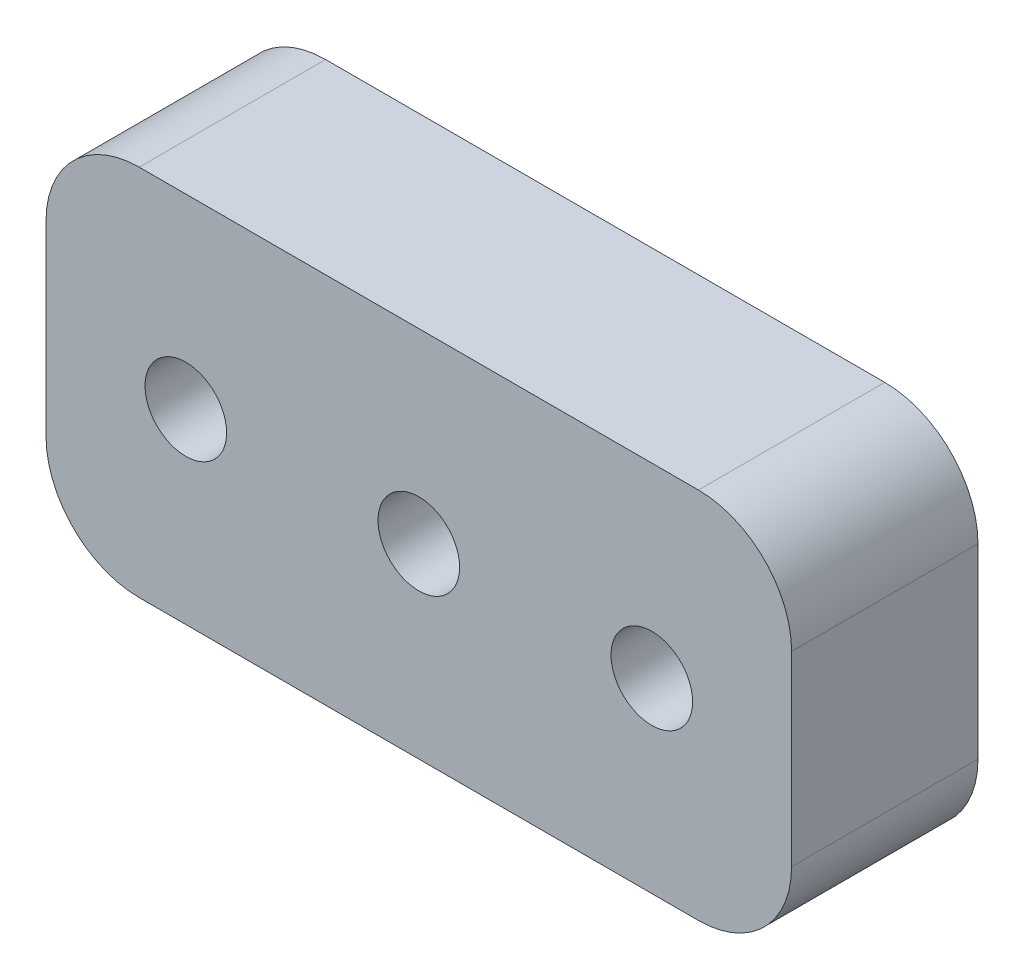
ISO-10303-21;
HEADER;
FILE_DESCRIPTION(('STEP AP214'),'2;1');
FILE_NAME('part.step','',(''),(''),'','','');
FILE_SCHEMA(('AUTOMOTIVE_DESIGN { 1 0 10303 214 1 1 1 1 }'));
ENDSEC;
DATA;
#1=APPLICATION_CONTEXT('core data for automotive mechanical design processes');
#2=APPLICATION_PROTOCOL_DEFINITION('international standard','automotive_design',2000,#1);
#3=PRODUCT_CONTEXT('',#1,'mechanical');
#4=PRODUCT('Part','Part','',(#3));
#5=PRODUCT_RELATED_PRODUCT_CATEGORY('part','',(#4));
#6=PRODUCT_DEFINITION_FORMATION('','',#4);
#7=PRODUCT_DEFINITION_CONTEXT('part definition',#1,'design');
#8=PRODUCT_DEFINITION('design','',#6,#7);
#9=PRODUCT_DEFINITION_SHAPE('','',#8);
#10=(LENGTH_UNIT() NAMED_UNIT(*) SI_UNIT(.MILLI.,.METRE.));
#11=(NAMED_UNIT(*) PLANE_ANGLE_UNIT() SI_UNIT($,.RADIAN.));
#12=(NAMED_UNIT(*) SI_UNIT($,.STERADIAN.) SOLID_ANGLE_UNIT());
#13=UNCERTAINTY_MEASURE_WITH_UNIT(LENGTH_MEASURE(1.E-05),#10,'distance_accuracy_value','');
#14=(GEOMETRIC_REPRESENTATION_CONTEXT(3) GLOBAL_UNCERTAINTY_ASSIGNED_CONTEXT((#13)) GLOBAL_UNIT_ASSIGNED_CONTEXT((#10,
#11,#12)) REPRESENTATION_CONTEXT('',''));
#15=CARTESIAN_POINT('',(0.,0.,0.));
#16=DIRECTION('',(0.,0.,1.));
#17=DIRECTION('',(1.,0.,0.));
#18=AXIS2_PLACEMENT_3D('',#15,#16,#17);
#19=CARTESIAN_POINT('',(0.,0.,12.7));
#20=DIRECTION('',(0.,0.,1.));
#21=DIRECTION('',(1.,0.,0.));
#22=AXIS2_PLACEMENT_3D('',#19,#20,#21);
#23=PLANE('',#22);
#24=CARTESIAN_POINT('',(0.,0.,12.7));
#25=DIRECTION('',(0.,0.,1.));
#26=DIRECTION('',(1.,0.,0.));
#27=AXIS2_PLACEMENT_3D('',#24,#25,#26);
#28=CIRCLE('',#27,2.77876);
#29=CARTESIAN_POINT('',(2.77876,0.,12.7));
#30=VERTEX_POINT('',#29);
#31=EDGE_CURVE('E192',#30,#30,#28,.T.);
#32=ORIENTED_EDGE('',*,*,#31,.F.);
#33=EDGE_LOOP('',(#32));
#34=FACE_BOUND('',#33,.T.);
#35=DIRECTION('',(0.,1.,0.));
#36=VECTOR('',#35,1.);
#37=CARTESIAN_POINT('',(25.4,12.7,12.7));
#38=LINE('',#37,#36);
#39=CARTESIAN_POINT('',(25.4,-6.35,12.7));
#40=VERTEX_POINT('',#39);
#41=CARTESIAN_POINT('',(25.4,6.35,12.7));
#42=VERTEX_POINT('',#41);
#43=EDGE_CURVE('E136',#40,#42,#38,.T.);
#44=ORIENTED_EDGE('',*,*,#43,.T.);
#45=CARTESIAN_POINT('',(19.05,6.35,12.7));
#46=DIRECTION('',(0.,0.,1.));
#47=DIRECTION('',(1.,0.,0.));
#48=AXIS2_PLACEMENT_3D('',#45,#46,#47);
#49=CIRCLE('',#48,6.35);
#50=CARTESIAN_POINT('',(19.05,12.7,12.7));
#51=VERTEX_POINT('',#50);
#52=EDGE_CURVE('E151',#42,#51,#49,.T.);
#53=ORIENTED_EDGE('',*,*,#52,.T.);
#54=DIRECTION('',(-1.,0.,0.));
#55=VECTOR('',#54,1.);
#56=CARTESIAN_POINT('',(-25.4,12.7,12.7));
#57=LINE('',#56,#55);
#58=CARTESIAN_POINT('',(-19.05,12.7,12.7));
#59=VERTEX_POINT('',#58);
#60=EDGE_CURVE('E118',#51,#59,#57,.T.);
#61=ORIENTED_EDGE('',*,*,#60,.T.);
#62=CARTESIAN_POINT('',(-19.05,6.35,12.7));
#63=DIRECTION('',(0.,0.,1.));
#64=DIRECTION('',(1.,0.,0.));
#65=AXIS2_PLACEMENT_3D('',#62,#63,#64);
#66=CIRCLE('',#65,6.35);
#67=CARTESIAN_POINT('',(-25.4,6.35,12.7));
#68=VERTEX_POINT('',#67);
#69=EDGE_CURVE('E149',#59,#68,#66,.T.);
#70=ORIENTED_EDGE('',*,*,#69,.T.);
#71=DIRECTION('',(0.,-1.,0.));
#72=VECTOR('',#71,1.);
#73=CARTESIAN_POINT('',(-25.4,12.7,12.7));
#74=LINE('',#73,#72);
#75=CARTESIAN_POINT('',(-25.4,-6.35,12.7));
#76=VERTEX_POINT('',#75);
#77=EDGE_CURVE('E171',#68,#76,#74,.T.);
#78=ORIENTED_EDGE('',*,*,#77,.T.);
#79=CARTESIAN_POINT('',(-19.05,-6.35,12.7));
#80=DIRECTION('',(0.,0.,1.));
#81=DIRECTION('',(1.,0.,0.));
#82=AXIS2_PLACEMENT_3D('',#79,#80,#81);
#83=CIRCLE('',#82,6.35);
#84=CARTESIAN_POINT('',(-19.05,-12.7,12.7));
#85=VERTEX_POINT('',#84);
#86=EDGE_CURVE('E53',#76,#85,#83,.T.);
#87=ORIENTED_EDGE('',*,*,#86,.T.);
#88=DIRECTION('',(1.,0.,0.));
#89=VECTOR('',#88,1.);
#90=CARTESIAN_POINT('',(-25.4,-12.7,12.7));
#91=LINE('',#90,#89);
#92=CARTESIAN_POINT('',(19.05,-12.7,12.7));
#93=VERTEX_POINT('',#92);
#94=EDGE_CURVE('E137',#85,#93,#91,.T.);
#95=ORIENTED_EDGE('',*,*,#94,.T.);
#96=CARTESIAN_POINT('',(19.05,-6.35,12.7));
#97=DIRECTION('',(0.,0.,1.));
#98=DIRECTION('',(1.,0.,0.));
#99=AXIS2_PLACEMENT_3D('',#96,#97,#98);
#100=CIRCLE('',#99,6.35);
#101=EDGE_CURVE('E147',#93,#40,#100,.T.);
#102=ORIENTED_EDGE('',*,*,#101,.T.);
#103=EDGE_LOOP('',(#44,#53,#61,#70,#78,#87,#95,#102));
#104=FACE_BOUND('',#103,.T.);
#105=CARTESIAN_POINT('',(15.875,0.,12.7));
#106=DIRECTION('',(0.,0.,1.));
#107=DIRECTION('',(1.,0.,0.));
#108=AXIS2_PLACEMENT_3D('',#105,#106,#107);
#109=CIRCLE('',#108,2.77876);
#110=CARTESIAN_POINT('',(18.65376,0.,12.7));
#111=VERTEX_POINT('',#110);
#112=EDGE_CURVE('E131',#111,#111,#109,.T.);
#113=ORIENTED_EDGE('',*,*,#112,.F.);
#114=EDGE_LOOP('',(#113));
#115=FACE_BOUND('',#114,.T.);
#116=CARTESIAN_POINT('',(-15.875,0.,12.7));
#117=DIRECTION('',(0.,0.,1.));
#118=DIRECTION('',(1.,0.,0.));
#119=AXIS2_PLACEMENT_3D('',#116,#117,#118);
#120=CIRCLE('',#119,2.77876);
#121=CARTESIAN_POINT('',(-13.09624,0.,12.7));
#122=VERTEX_POINT('',#121);
#123=EDGE_CURVE('E186',#122,#122,#120,.T.);
#124=ORIENTED_EDGE('',*,*,#123,.F.);
#125=EDGE_LOOP('',(#124));
#126=FACE_BOUND('',#125,.T.);
#127=ADVANCED_FACE('F33',(#34,#104,#115,#126),#23,.T.);
#128=CARTESIAN_POINT('',(0.,0.,0.));
#129=DIRECTION('',(0.,0.,1.));
#130=DIRECTION('',(1.,0.,0.));
#131=AXIS2_PLACEMENT_3D('',#128,#129,#130);
#132=PLANE('',#131);
#133=CARTESIAN_POINT('',(0.,0.,0.));
#134=DIRECTION('',(0.,0.,1.));
#135=DIRECTION('',(1.,0.,0.));
#136=AXIS2_PLACEMENT_3D('',#133,#134,#135);
#137=CIRCLE('',#136,2.77876);
#138=CARTESIAN_POINT('',(2.77876,0.,0.));
#139=VERTEX_POINT('',#138);
#140=EDGE_CURVE('E188',#139,#139,#137,.T.);
#141=ORIENTED_EDGE('',*,*,#140,.T.);
#142=EDGE_LOOP('',(#141));
#143=FACE_BOUND('',#142,.T.);
#144=DIRECTION('',(-1.,0.,0.));
#145=VECTOR('',#144,1.);
#146=CARTESIAN_POINT('',(-25.4,12.7,0.));
#147=LINE('',#146,#145);
#148=CARTESIAN_POINT('',(19.05,12.7,0.));
#149=VERTEX_POINT('',#148);
#150=CARTESIAN_POINT('',(-19.05,12.7,0.));
#151=VERTEX_POINT('',#150);
#152=EDGE_CURVE('E115',#149,#151,#147,.T.);
#153=ORIENTED_EDGE('',*,*,#152,.F.);
#154=CARTESIAN_POINT('',(19.05,6.35,0.));
#155=DIRECTION('',(0.,0.,1.));
#156=DIRECTION('',(1.,0.,0.));
#157=AXIS2_PLACEMENT_3D('',#154,#155,#156);
#158=CIRCLE('',#157,6.35);
#159=CARTESIAN_POINT('',(25.4,6.35,0.));
#160=VERTEX_POINT('',#159);
#161=EDGE_CURVE('E98',#149,#160,#158,.F.);
#162=ORIENTED_EDGE('',*,*,#161,.T.);
#163=DIRECTION('',(0.,1.,0.));
#164=VECTOR('',#163,1.);
#165=CARTESIAN_POINT('',(25.4,12.7,0.));
#166=LINE('',#165,#164);
#167=CARTESIAN_POINT('',(25.4,-6.35,0.));
#168=VERTEX_POINT('',#167);
#169=EDGE_CURVE('E126',#168,#160,#166,.T.);
#170=ORIENTED_EDGE('',*,*,#169,.F.);
#171=CARTESIAN_POINT('',(19.05,-6.35,0.));
#172=DIRECTION('',(0.,0.,1.));
#173=DIRECTION('',(1.,0.,0.));
#174=AXIS2_PLACEMENT_3D('',#171,#172,#173);
#175=CIRCLE('',#174,6.35);
#176=CARTESIAN_POINT('',(19.05,-12.7,0.));
#177=VERTEX_POINT('',#176);
#178=EDGE_CURVE('E140',#168,#177,#175,.F.);
#179=ORIENTED_EDGE('',*,*,#178,.T.);
#180=DIRECTION('',(1.,0.,0.));
#181=VECTOR('',#180,1.);
#182=CARTESIAN_POINT('',(-25.4,-12.7,0.));
#183=LINE('',#182,#181);
#184=CARTESIAN_POINT('',(-19.05,-12.7,0.));
#185=VERTEX_POINT('',#184);
#186=EDGE_CURVE('E129',#185,#177,#183,.T.);
#187=ORIENTED_EDGE('',*,*,#186,.F.);
#188=CARTESIAN_POINT('',(-19.05,-6.35,0.));
#189=DIRECTION('',(0.,0.,1.));
#190=DIRECTION('',(1.,0.,0.));
#191=AXIS2_PLACEMENT_3D('',#188,#189,#190);
#192=CIRCLE('',#191,6.35);
#193=CARTESIAN_POINT('',(-25.4,-6.35,0.));
#194=VERTEX_POINT('',#193);
#195=EDGE_CURVE('E119',#185,#194,#192,.F.);
#196=ORIENTED_EDGE('',*,*,#195,.T.);
#197=DIRECTION('',(0.,-1.,0.));
#198=VECTOR('',#197,1.);
#199=CARTESIAN_POINT('',(-25.4,12.7,0.));
#200=LINE('',#199,#198);
#201=CARTESIAN_POINT('',(-25.4,6.35,0.));
#202=VERTEX_POINT('',#201);
#203=EDGE_CURVE('E125',#202,#194,#200,.T.);
#204=ORIENTED_EDGE('',*,*,#203,.F.);
#205=CARTESIAN_POINT('',(-19.05,6.35,0.));
#206=DIRECTION('',(0.,0.,1.));
#207=DIRECTION('',(1.,0.,0.));
#208=AXIS2_PLACEMENT_3D('',#205,#206,#207);
#209=CIRCLE('',#208,6.35);
#210=EDGE_CURVE('E109',#202,#151,#209,.F.);
#211=ORIENTED_EDGE('',*,*,#210,.T.);
#212=EDGE_LOOP('',(#153,#162,#170,#179,#187,#196,#204,#211));
#213=FACE_BOUND('',#212,.T.);
#214=CARTESIAN_POINT('',(15.875,0.,0.));
#215=DIRECTION('',(0.,0.,1.));
#216=DIRECTION('',(1.,0.,0.));
#217=AXIS2_PLACEMENT_3D('',#214,#215,#216);
#218=CIRCLE('',#217,2.77876);
#219=CARTESIAN_POINT('',(18.65376,0.,0.));
#220=VERTEX_POINT('',#219);
#221=EDGE_CURVE('E174',#220,#220,#218,.T.);
#222=ORIENTED_EDGE('',*,*,#221,.T.);
#223=EDGE_LOOP('',(#222));
#224=FACE_BOUND('',#223,.T.);
#225=CARTESIAN_POINT('',(-15.875,0.,0.));
#226=DIRECTION('',(0.,0.,1.));
#227=DIRECTION('',(1.,0.,0.));
#228=AXIS2_PLACEMENT_3D('',#225,#226,#227);
#229=CIRCLE('',#228,2.77876);
#230=CARTESIAN_POINT('',(-13.09624,0.,0.));
#231=VERTEX_POINT('',#230);
#232=EDGE_CURVE('E189',#231,#231,#229,.T.);
#233=ORIENTED_EDGE('',*,*,#232,.T.);
#234=EDGE_LOOP('',(#233));
#235=FACE_BOUND('',#234,.T.);
#236=ADVANCED_FACE('F122',(#143,#213,#224,#235),#132,.F.);
#237=CARTESIAN_POINT('',(25.4,12.7,12.7));
#238=DIRECTION('',(-1.,0.,0.));
#239=DIRECTION('',(0.,-1.,0.));
#240=AXIS2_PLACEMENT_3D('',#237,#238,#239);
#241=PLANE('',#240);
#242=ORIENTED_EDGE('',*,*,#169,.T.);
#243=DIRECTION('',(0.,0.,-1.));
#244=VECTOR('',#243,1.);
#245=CARTESIAN_POINT('',(25.4,6.35,12.7));
#246=LINE('',#245,#244);
#247=EDGE_CURVE('E103',#160,#42,#246,.F.);
#248=ORIENTED_EDGE('',*,*,#247,.T.);
#249=ORIENTED_EDGE('',*,*,#43,.F.);
#250=DIRECTION('',(0.,0.,-1.));
#251=VECTOR('',#250,1.);
#252=CARTESIAN_POINT('',(25.4,-6.35,12.7));
#253=LINE('',#252,#251);
#254=EDGE_CURVE('E108',#40,#168,#253,.T.);
#255=ORIENTED_EDGE('',*,*,#254,.T.);
#256=EDGE_LOOP('',(#242,#248,#249,#255));
#257=FACE_BOUND('',#256,.T.);
#258=ADVANCED_FACE('F168',(#257),#241,.F.);
#259=CARTESIAN_POINT('',(-25.4,12.7,12.7));
#260=DIRECTION('',(0.,-1.,0.));
#261=DIRECTION('',(0.,0.,-1.));
#262=AXIS2_PLACEMENT_3D('',#259,#260,#261);
#263=PLANE('',#262);
#264=ORIENTED_EDGE('',*,*,#60,.F.);
#265=DIRECTION('',(0.,0.,-1.));
#266=VECTOR('',#265,1.);
#267=CARTESIAN_POINT('',(19.05,12.7,12.7));
#268=LINE('',#267,#266);
#269=EDGE_CURVE('E102',#51,#149,#268,.T.);
#270=ORIENTED_EDGE('',*,*,#269,.T.);
#271=ORIENTED_EDGE('',*,*,#152,.T.);
#272=DIRECTION('',(0.,0.,-1.));
#273=VECTOR('',#272,1.);
#274=CARTESIAN_POINT('',(-19.05,12.7,12.7));
#275=LINE('',#274,#273);
#276=EDGE_CURVE('E120',#151,#59,#275,.F.);
#277=ORIENTED_EDGE('',*,*,#276,.T.);
#278=EDGE_LOOP('',(#264,#270,#271,#277));
#279=FACE_BOUND('',#278,.T.);
#280=ADVANCED_FACE('F114',(#279),#263,.F.);
#281=CARTESIAN_POINT('',(-25.4,12.7,12.7));
#282=DIRECTION('',(1.,0.,0.));
#283=DIRECTION('',(0.,1.,0.));
#284=AXIS2_PLACEMENT_3D('',#281,#282,#283);
#285=PLANE('',#284);
#286=ORIENTED_EDGE('',*,*,#77,.F.);
#287=DIRECTION('',(0.,0.,-1.));
#288=VECTOR('',#287,1.);
#289=CARTESIAN_POINT('',(-25.4,6.35,12.7));
#290=LINE('',#289,#288);
#291=EDGE_CURVE('E155',#68,#202,#290,.T.);
#292=ORIENTED_EDGE('',*,*,#291,.T.);
#293=ORIENTED_EDGE('',*,*,#203,.T.);
#294=DIRECTION('',(0.,0.,-1.));
#295=VECTOR('',#294,1.);
#296=CARTESIAN_POINT('',(-25.4,-6.35,12.7));
#297=LINE('',#296,#295);
#298=EDGE_CURVE('E153',#194,#76,#297,.F.);
#299=ORIENTED_EDGE('',*,*,#298,.T.);
#300=EDGE_LOOP('',(#286,#292,#293,#299));
#301=FACE_BOUND('',#300,.T.);
#302=ADVANCED_FACE('F214',(#301),#285,.F.);
#303=CARTESIAN_POINT('',(-25.4,-12.7,12.7));
#304=DIRECTION('',(0.,1.,0.));
#305=DIRECTION('',(0.,0.,1.));
#306=AXIS2_PLACEMENT_3D('',#303,#304,#305);
#307=PLANE('',#306);
#308=ORIENTED_EDGE('',*,*,#186,.T.);
#309=DIRECTION('',(0.,0.,-1.));
#310=VECTOR('',#309,1.);
#311=CARTESIAN_POINT('',(19.05,-12.7,12.7));
#312=LINE('',#311,#310);
#313=EDGE_CURVE('E11',#177,#93,#312,.F.);
#314=ORIENTED_EDGE('',*,*,#313,.T.);
#315=ORIENTED_EDGE('',*,*,#94,.F.);
#316=DIRECTION('',(0.,0.,-1.));
#317=VECTOR('',#316,1.);
#318=CARTESIAN_POINT('',(-19.05,-12.7,12.7));
#319=LINE('',#318,#317);
#320=EDGE_CURVE('E41',#85,#185,#319,.T.);
#321=ORIENTED_EDGE('',*,*,#320,.T.);
#322=EDGE_LOOP('',(#308,#314,#315,#321));
#323=FACE_BOUND('',#322,.T.);
#324=ADVANCED_FACE('F160',(#323),#307,.F.);
#325=CARTESIAN_POINT('',(15.875,0.,12.7));
#326=DIRECTION('',(0.,0.,-1.));
#327=DIRECTION('',(-1.,0.,0.));
#328=AXIS2_PLACEMENT_3D('',#325,#326,#327);
#329=CYLINDRICAL_SURFACE('',#328,2.77876);
#330=ORIENTED_EDGE('',*,*,#112,.T.);
#331=EDGE_LOOP('',(#330));
#332=FACE_BOUND('',#331,.T.);
#333=ORIENTED_EDGE('',*,*,#221,.F.);
#334=EDGE_LOOP('',(#333));
#335=FACE_BOUND('',#334,.T.);
#336=ADVANCED_FACE('F203',(#332,#335),#329,.F.);
#337=CARTESIAN_POINT('',(0.,0.,12.7));
#338=DIRECTION('',(0.,0.,-1.));
#339=DIRECTION('',(-1.,0.,0.));
#340=AXIS2_PLACEMENT_3D('',#337,#338,#339);
#341=CYLINDRICAL_SURFACE('',#340,2.77876);
#342=ORIENTED_EDGE('',*,*,#31,.T.);
#343=EDGE_LOOP('',(#342));
#344=FACE_BOUND('',#343,.T.);
#345=ORIENTED_EDGE('',*,*,#140,.F.);
#346=EDGE_LOOP('',(#345));
#347=FACE_BOUND('',#346,.T.);
#348=ADVANCED_FACE('F205',(#344,#347),#341,.F.);
#349=CARTESIAN_POINT('',(-15.875,0.,12.7));
#350=DIRECTION('',(0.,0.,-1.));
#351=DIRECTION('',(-1.,0.,0.));
#352=AXIS2_PLACEMENT_3D('',#349,#350,#351);
#353=CYLINDRICAL_SURFACE('',#352,2.77876);
#354=ORIENTED_EDGE('',*,*,#123,.T.);
#355=EDGE_LOOP('',(#354));
#356=FACE_BOUND('',#355,.T.);
#357=ORIENTED_EDGE('',*,*,#232,.F.);
#358=EDGE_LOOP('',(#357));
#359=FACE_BOUND('',#358,.T.);
#360=ADVANCED_FACE('F211',(#356,#359),#353,.F.);
#361=CARTESIAN_POINT('',(19.05,6.35,12.7));
#362=DIRECTION('',(0.,0.,-1.));
#363=DIRECTION('',(-1.,0.,0.));
#364=AXIS2_PLACEMENT_3D('',#361,#362,#363);
#365=CYLINDRICAL_SURFACE('',#364,6.35);
#366=ORIENTED_EDGE('',*,*,#52,.F.);
#367=ORIENTED_EDGE('',*,*,#247,.F.);
#368=ORIENTED_EDGE('',*,*,#161,.F.);
#369=ORIENTED_EDGE('',*,*,#269,.F.);
#370=EDGE_LOOP('',(#366,#367,#368,#369));
#371=FACE_BOUND('',#370,.T.);
#372=ADVANCED_FACE('F101',(#371),#365,.T.);
#373=CARTESIAN_POINT('',(-19.05,6.35,12.7));
#374=DIRECTION('',(0.,0.,-1.));
#375=DIRECTION('',(-1.,0.,0.));
#376=AXIS2_PLACEMENT_3D('',#373,#374,#375);
#377=CYLINDRICAL_SURFACE('',#376,6.35);
#378=ORIENTED_EDGE('',*,*,#69,.F.);
#379=ORIENTED_EDGE('',*,*,#276,.F.);
#380=ORIENTED_EDGE('',*,*,#210,.F.);
#381=ORIENTED_EDGE('',*,*,#291,.F.);
#382=EDGE_LOOP('',(#378,#379,#380,#381));
#383=FACE_BOUND('',#382,.T.);
#384=ADVANCED_FACE('F230',(#383),#377,.T.);
#385=CARTESIAN_POINT('',(19.05,-6.35,12.7));
#386=DIRECTION('',(0.,0.,-1.));
#387=DIRECTION('',(-1.,0.,0.));
#388=AXIS2_PLACEMENT_3D('',#385,#386,#387);
#389=CYLINDRICAL_SURFACE('',#388,6.35);
#390=ORIENTED_EDGE('',*,*,#101,.F.);
#391=ORIENTED_EDGE('',*,*,#313,.F.);
#392=ORIENTED_EDGE('',*,*,#178,.F.);
#393=ORIENTED_EDGE('',*,*,#254,.F.);
#394=EDGE_LOOP('',(#390,#391,#392,#393));
#395=FACE_BOUND('',#394,.T.);
#396=ADVANCED_FACE('F165',(#395),#389,.T.);
#397=CARTESIAN_POINT('',(-19.05,-6.35,12.7));
#398=DIRECTION('',(0.,0.,-1.));
#399=DIRECTION('',(-1.,0.,0.));
#400=AXIS2_PLACEMENT_3D('',#397,#398,#399);
#401=CYLINDRICAL_SURFACE('',#400,6.35);
#402=ORIENTED_EDGE('',*,*,#86,.F.);
#403=ORIENTED_EDGE('',*,*,#298,.F.);
#404=ORIENTED_EDGE('',*,*,#195,.F.);
#405=ORIENTED_EDGE('',*,*,#320,.F.);
#406=EDGE_LOOP('',(#402,#403,#404,#405));
#407=FACE_BOUND('',#406,.T.);
#408=ADVANCED_FACE('F35',(#407),#401,.T.);
#409=CLOSED_SHELL('',(#127,#236,#258,#280,#302,#324,#336,#348,#360,#372,#384,#396,#408));
#410=MANIFOLD_SOLID_BREP('B2',#409);
#411=ADVANCED_BREP_SHAPE_REPRESENTATION('',(#18,#410),#14);
#412=SHAPE_DEFINITION_REPRESENTATION(#9,#411);
ENDSEC;
END-ISO-10303-21;
